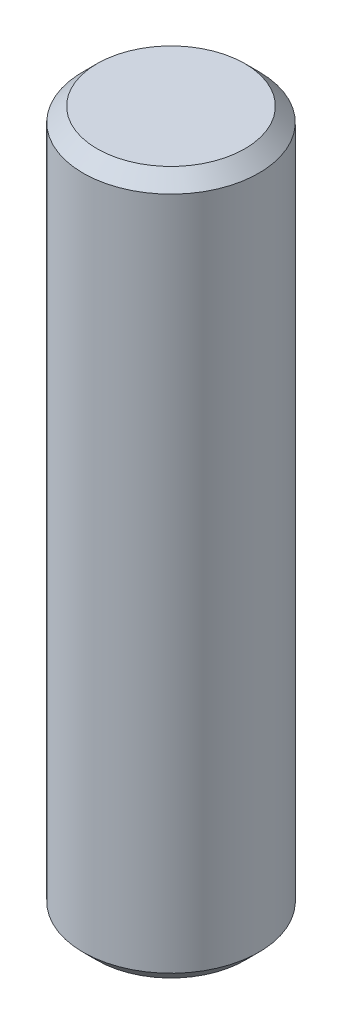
ISO-10303-21;
HEADER;
FILE_DESCRIPTION(('STEP AP214'),'2;1');
FILE_NAME('part.step','',(''),(''),'','','');
FILE_SCHEMA(('AUTOMOTIVE_DESIGN { 1 0 10303 214 1 1 1 1 }'));
ENDSEC;
DATA;
#1=APPLICATION_CONTEXT('core data for automotive mechanical design processes');
#2=APPLICATION_PROTOCOL_DEFINITION('international standard','automotive_design',2000,#1);
#3=PRODUCT_CONTEXT('',#1,'mechanical');
#4=PRODUCT('Part','Part','',(#3));
#5=PRODUCT_RELATED_PRODUCT_CATEGORY('part','',(#4));
#6=PRODUCT_DEFINITION_FORMATION('','',#4);
#7=PRODUCT_DEFINITION_CONTEXT('part definition',#1,'design');
#8=PRODUCT_DEFINITION('design','',#6,#7);
#9=PRODUCT_DEFINITION_SHAPE('','',#8);
#10=(LENGTH_UNIT() NAMED_UNIT(*) SI_UNIT(.MILLI.,.METRE.));
#11=(NAMED_UNIT(*) PLANE_ANGLE_UNIT() SI_UNIT($,.RADIAN.));
#12=(NAMED_UNIT(*) SI_UNIT($,.STERADIAN.) SOLID_ANGLE_UNIT());
#13=UNCERTAINTY_MEASURE_WITH_UNIT(LENGTH_MEASURE(1.E-05),#10,'distance_accuracy_value','');
#14=(GEOMETRIC_REPRESENTATION_CONTEXT(3) GLOBAL_UNCERTAINTY_ASSIGNED_CONTEXT((#13)) GLOBAL_UNIT_ASSIGNED_CONTEXT((#10,
#11,#12)) REPRESENTATION_CONTEXT('',''));
#15=CARTESIAN_POINT('',(0.,0.,0.));
#16=DIRECTION('',(0.,0.,1.));
#17=DIRECTION('',(1.,0.,0.));
#18=AXIS2_PLACEMENT_3D('',#15,#16,#17);
#19=CARTESIAN_POINT('',(0.,19.05,0.));
#20=DIRECTION('',(0.,-1.,0.));
#21=DIRECTION('',(0.,0.,-1.));
#22=AXIS2_PLACEMENT_3D('',#19,#20,#21);
#23=CYLINDRICAL_SURFACE('',#22,4.76504);
#24=CARTESIAN_POINT('',(0.,-18.288,0.));
#25=DIRECTION('',(0.,1.,0.));
#26=DIRECTION('',(0.,0.,1.));
#27=AXIS2_PLACEMENT_3D('',#24,#25,#26);
#28=CIRCLE('',#27,4.76504);
#29=CARTESIAN_POINT('',(0.,-18.288,-4.76504));
#30=VERTEX_POINT('',#29);
#31=EDGE_CURVE('E40',#30,#30,#28,.T.);
#32=CARTESIAN_POINT('',(0.,18.288,0.));
#33=DIRECTION('',(0.,1.,0.));
#34=DIRECTION('',(0.,0.,1.));
#35=AXIS2_PLACEMENT_3D('',#32,#33,#34);
#36=CIRCLE('',#35,4.76504);
#37=CARTESIAN_POINT('',(0.,18.288,-4.76504));
#38=VERTEX_POINT('',#37);
#39=EDGE_CURVE('E44',#38,#38,#36,.F.);
#40=CARTESIAN_POINT('',(0.,-18.288,-4.76504));
#41=CARTESIAN_POINT('',(0.,-17.907,-4.76504));
#42=CARTESIAN_POINT('',(0.,-17.526,-4.76504));
#43=CARTESIAN_POINT('',(0.,-16.764,-4.76504));
#44=CARTESIAN_POINT('',(0.,-16.383,-4.76504));
#45=CARTESIAN_POINT('',(0.,-15.621,-4.76504));
#46=CARTESIAN_POINT('',(0.,-15.24,-4.76504));
#47=CARTESIAN_POINT('',(0.,-14.478,-4.76504));
#48=CARTESIAN_POINT('',(0.,-14.097,-4.76504));
#49=CARTESIAN_POINT('',(0.,-13.335,-4.76504));
#50=CARTESIAN_POINT('',(0.,-12.954,-4.76504));
#51=CARTESIAN_POINT('',(0.,-12.192,-4.76504));
#52=CARTESIAN_POINT('',(0.,-11.811,-4.76504));
#53=CARTESIAN_POINT('',(0.,-11.049,-4.76504));
#54=CARTESIAN_POINT('',(0.,-10.668,-4.76504));
#55=CARTESIAN_POINT('',(0.,-9.90599999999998,-4.76504));
#56=CARTESIAN_POINT('',(0.,-9.52499999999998,-4.76504));
#57=CARTESIAN_POINT('',(0.,-8.76299999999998,-4.76504));
#58=CARTESIAN_POINT('',(0.,-8.38199999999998,-4.76504));
#59=CARTESIAN_POINT('',(0.,-7.61999999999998,-4.76504));
#60=CARTESIAN_POINT('',(0.,-7.23899999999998,-4.76504));
#61=CARTESIAN_POINT('',(0.,-6.47699999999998,-4.76504));
#62=CARTESIAN_POINT('',(0.,-6.09599999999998,-4.76504));
#63=CARTESIAN_POINT('',(0.,-5.33399999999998,-4.76504));
#64=CARTESIAN_POINT('',(0.,-4.95299999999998,-4.76504));
#65=CARTESIAN_POINT('',(0.,-4.19099999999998,-4.76504));
#66=CARTESIAN_POINT('',(0.,-3.80999999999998,-4.76504));
#67=CARTESIAN_POINT('',(0.,-3.04799999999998,-4.76504));
#68=CARTESIAN_POINT('',(0.,-2.66699999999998,-4.76504));
#69=CARTESIAN_POINT('',(0.,-1.90499999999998,-4.76504));
#70=CARTESIAN_POINT('',(0.,-1.52399999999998,-4.76504));
#71=CARTESIAN_POINT('',(0.,-0.761999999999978,-4.76504));
#72=CARTESIAN_POINT('',(0.,-0.380999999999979,-4.76504));
#73=CARTESIAN_POINT('',(0.,0.38100000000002,-4.76504));
#74=CARTESIAN_POINT('',(0.,0.76200000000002,-4.76504));
#75=CARTESIAN_POINT('',(0.,1.52400000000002,-4.76504));
#76=CARTESIAN_POINT('',(0.,1.90500000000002,-4.76504));
#77=CARTESIAN_POINT('',(0.,2.66700000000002,-4.76504));
#78=CARTESIAN_POINT('',(0.,3.04800000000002,-4.76504));
#79=CARTESIAN_POINT('',(0.,3.81000000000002,-4.76504));
#80=CARTESIAN_POINT('',(0.,4.19100000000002,-4.76504));
#81=CARTESIAN_POINT('',(0.,4.95300000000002,-4.76504));
#82=CARTESIAN_POINT('',(0.,5.33400000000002,-4.76504));
#83=CARTESIAN_POINT('',(0.,6.09600000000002,-4.76504));
#84=CARTESIAN_POINT('',(0.,6.47700000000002,-4.76504));
#85=CARTESIAN_POINT('',(0.,7.23900000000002,-4.76504));
#86=CARTESIAN_POINT('',(0.,7.62000000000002,-4.76504));
#87=CARTESIAN_POINT('',(0.,8.38200000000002,-4.76504));
#88=CARTESIAN_POINT('',(0.,8.76300000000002,-4.76504));
#89=CARTESIAN_POINT('',(0.,9.52500000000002,-4.76504));
#90=CARTESIAN_POINT('',(0.,9.90600000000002,-4.76504));
#91=CARTESIAN_POINT('',(0.,10.668,-4.76504));
#92=CARTESIAN_POINT('',(0.,11.049,-4.76504));
#93=CARTESIAN_POINT('',(0.,11.811,-4.76504));
#94=CARTESIAN_POINT('',(0.,12.192,-4.76504));
#95=CARTESIAN_POINT('',(0.,12.954,-4.76504));
#96=CARTESIAN_POINT('',(0.,13.335,-4.76504));
#97=CARTESIAN_POINT('',(0.,14.097,-4.76504));
#98=CARTESIAN_POINT('',(0.,14.478,-4.76504));
#99=CARTESIAN_POINT('',(0.,15.24,-4.76504));
#100=CARTESIAN_POINT('',(0.,15.621,-4.76504));
#101=CARTESIAN_POINT('',(0.,16.383,-4.76504));
#102=CARTESIAN_POINT('',(0.,16.764,-4.76504));
#103=CARTESIAN_POINT('',(0.,17.526,-4.76504));
#104=CARTESIAN_POINT('',(0.,17.907,-4.76504));
#105=CARTESIAN_POINT('',(0.,18.288,-4.76504));
#106=B_SPLINE_CURVE_WITH_KNOTS('',3,(#40,#41,#42,#43,#44,#45,#46,#47,#48,#49,#50,#51,#52,#53,
#54,#55,#56,#57,#58,#59,#60,#61,#62,#63,#64,#65,#66,#67,#68,#69,#70,#71,#72,#73,#74,#75,#76,#77,
#78,#79,#80,#81,#82,#83,#84,#85,#86,#87,#88,#89,#90,#91,#92,#93,#94,#95,#96,#97,#98,#99,#100,
#101,#102,#103,#104,#105),.UNSPECIFIED.,.F.,.F.,(4,2,2,2,2,2,2,2,2,2,2,2,2,2,2,2,2,2,2,2,2,2,2,
2,2,2,2,2,2,2,2,2,4),(0.,1.143,2.286,3.429,4.572,5.715,6.858,8.001,9.144,10.287,11.43,12.573,
13.716,14.859,16.002,17.145,18.288,19.431,20.574,21.717,22.86,24.003,25.146,26.289,27.432,
28.575,29.718,30.861,32.004,33.147,34.29,35.433,36.576),.UNSPECIFIED.);
#107=EDGE_CURVE('BSEAM29',#30,#38,#106,.T.);
#108=ORIENTED_EDGE('',*,*,#31,.T.);
#109=ORIENTED_EDGE('',*,*,#39,.T.);
#110=ORIENTED_EDGE('',*,*,#107,.T.);
#111=ORIENTED_EDGE('',*,*,#107,.F.);
#112=EDGE_LOOP('',(#108,#110,#109,#111));
#113=FACE_BOUND('',#112,.T.);
#114=ADVANCED_FACE('F29',(#113),#23,.T.);
#115=CARTESIAN_POINT('',(0.,19.05,0.));
#116=DIRECTION('',(0.,1.,0.));
#117=DIRECTION('',(0.,0.,1.));
#118=AXIS2_PLACEMENT_3D('',#115,#116,#117);
#119=PLANE('',#118);
#120=CARTESIAN_POINT('',(0.,19.05,0.));
#121=DIRECTION('',(0.,1.,0.));
#122=DIRECTION('',(0.,0.,1.));
#123=AXIS2_PLACEMENT_3D('',#120,#121,#122);
#124=CIRCLE('',#123,4.00304000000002);
#125=CARTESIAN_POINT('',(0.,19.05,4.00304000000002));
#126=VERTEX_POINT('',#125);
#127=EDGE_CURVE('E10',#126,#126,#124,.T.);
#128=ORIENTED_EDGE('',*,*,#127,.T.);
#129=EDGE_LOOP('',(#128));
#130=FACE_BOUND('',#129,.T.);
#131=ADVANCED_FACE('F60',(#130),#119,.T.);
#132=CARTESIAN_POINT('',(0.,-19.05,0.));
#133=DIRECTION('',(0.,1.,0.));
#134=DIRECTION('',(0.,0.,1.));
#135=AXIS2_PLACEMENT_3D('',#132,#133,#134);
#136=PLANE('',#135);
#137=CARTESIAN_POINT('',(0.,-19.05,0.));
#138=DIRECTION('',(0.,1.,0.));
#139=DIRECTION('',(0.,0.,1.));
#140=AXIS2_PLACEMENT_3D('',#137,#138,#139);
#141=CIRCLE('',#140,4.00303999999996);
#142=CARTESIAN_POINT('',(0.,-19.05,4.00303999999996));
#143=VERTEX_POINT('',#142);
#144=EDGE_CURVE('E36',#143,#143,#141,.F.);
#145=ORIENTED_EDGE('',*,*,#144,.T.);
#146=EDGE_LOOP('',(#145));
#147=FACE_BOUND('',#146,.T.);
#148=ADVANCED_FACE('F57',(#147),#136,.F.);
#149=CARTESIAN_POINT('',(0.,-18.288,0.));
#150=DIRECTION('',(0.,1.,0.));
#151=DIRECTION('',(0.,0.,1.));
#152=AXIS2_PLACEMENT_3D('',#149,#150,#151);
#153=CONICAL_SURFACE('',#152,4.76504,0.785398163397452);
#154=ORIENTED_EDGE('',*,*,#144,.F.);
#155=EDGE_LOOP('',(#154));
#156=FACE_BOUND('',#155,.T.);
#157=ORIENTED_EDGE('',*,*,#31,.F.);
#158=EDGE_LOOP('',(#157));
#159=FACE_BOUND('',#158,.T.);
#160=ADVANCED_FACE('F53',(#156,#159),#153,.T.);
#161=CARTESIAN_POINT('',(0.,19.05,0.));
#162=DIRECTION('',(0.,-1.,0.));
#163=DIRECTION('',(0.,0.,-1.));
#164=AXIS2_PLACEMENT_3D('',#161,#162,#163);
#165=CONICAL_SURFACE('',#164,4.00304000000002,0.785398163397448);
#166=ORIENTED_EDGE('',*,*,#39,.F.);
#167=EDGE_LOOP('',(#166));
#168=FACE_BOUND('',#167,.T.);
#169=ORIENTED_EDGE('',*,*,#127,.F.);
#170=EDGE_LOOP('',(#169));
#171=FACE_BOUND('',#170,.T.);
#172=ADVANCED_FACE('F31',(#168,#171),#165,.T.);
#173=CLOSED_SHELL('',(#114,#131,#148,#160,#172));
#174=MANIFOLD_SOLID_BREP('B2',#173);
#175=ADVANCED_BREP_SHAPE_REPRESENTATION('',(#18,#174),#14);
#176=SHAPE_DEFINITION_REPRESENTATION(#9,#175);
ENDSEC;
END-ISO-10303-21;
